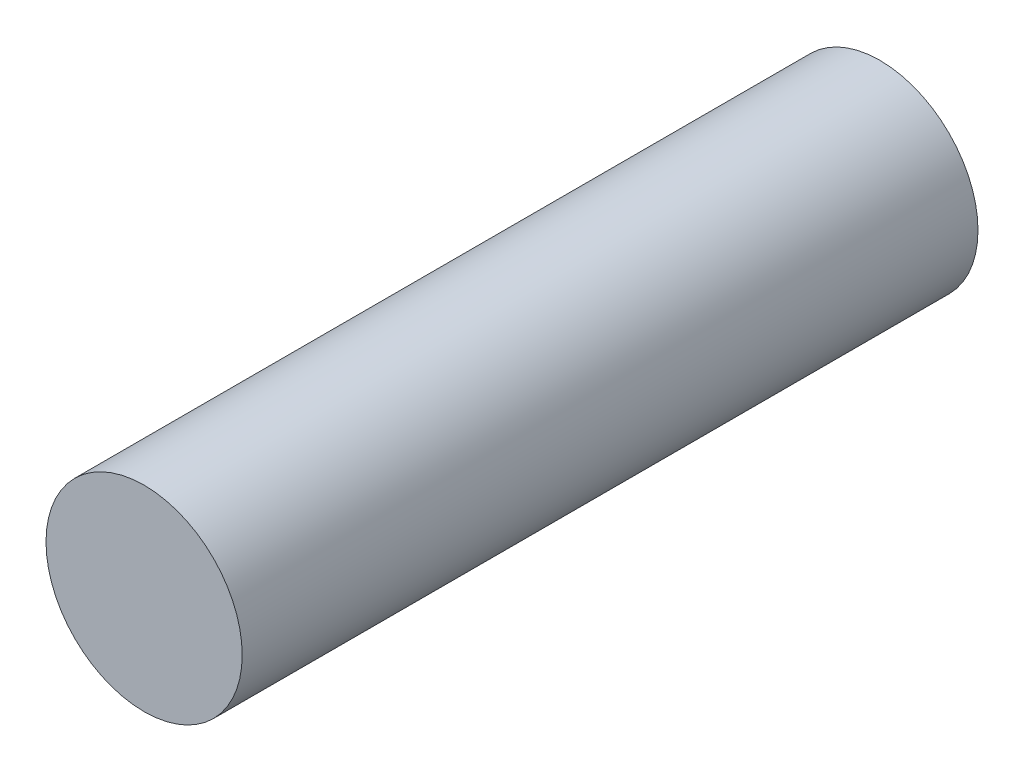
from build123d import *

# Parameters (mm, degrees)
SKETCH2_R           = 20
BOSS_EXTRUDE1_DEPTH = 75


with BuildPart() as part:
    # Sketch2 → Boss-Extrude1 (new, symmetric)
    with BuildSketch(Plane.XY):
        Circle(SKETCH2_R)
    extrude(amount=BOSS_EXTRUDE1_DEPTH, both=True)


solid = part.part
